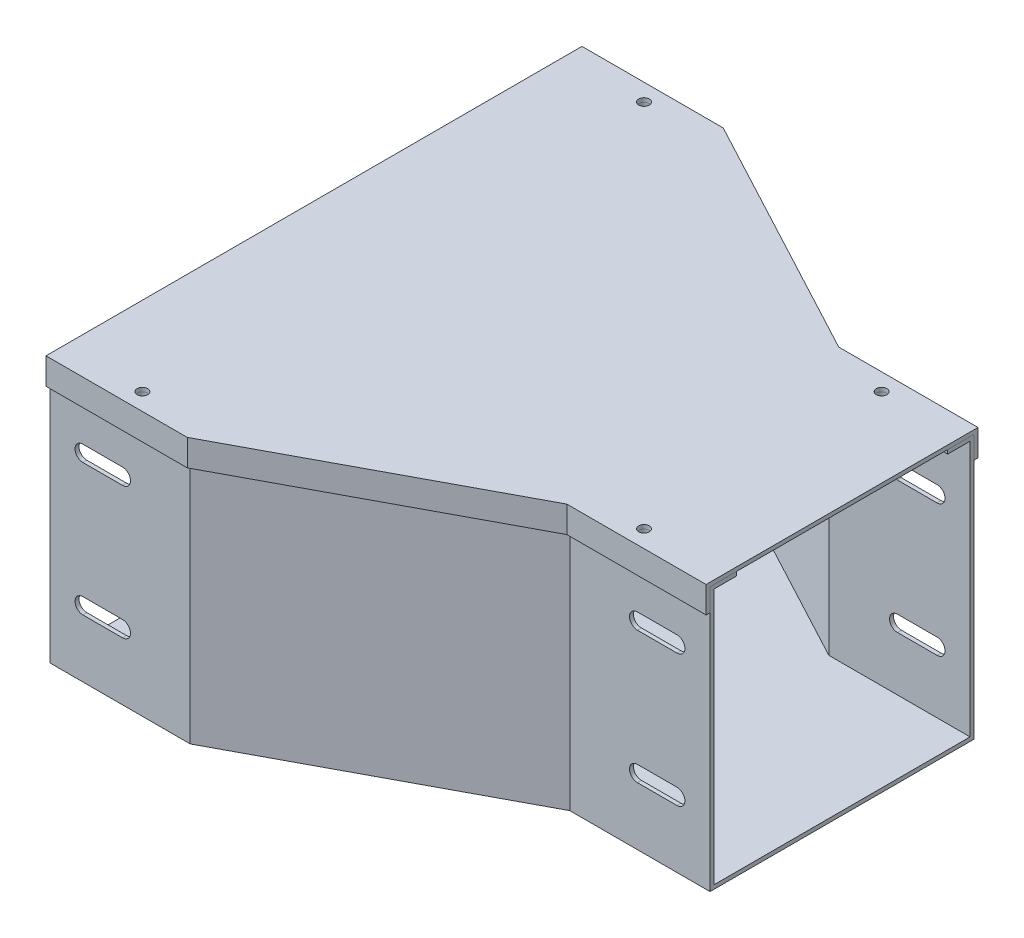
from build123d import *

# Parameters (mm, degrees)
BOSS_EXTRUDE1_DEPTH     = 1.5
EXTRUDE_THIN1_DEPTH     = 100
CUT_EXTRUDE1_DEPTH      = 151
CUT_EXTRUDE1_DEPTH_BACK = 151
EXTRUDE_THIN2_DEPTH     = 1.5
CUT_EXTRUDE2_REACH      = 175.205
SKETCH5_R               = 2
BOSS_EXTRUDE2_DEPTH     = 1.5
EXTRUDE_THIN3_DEPTH     = 10
SKETCH8_R               = 2
CUT_EXTRUDE3_DEPTH      = 1.5


with BuildPart() as part:
    # Sketch1 → Boss-Extrude1 (new body)
    with BuildSketch(Plane(origin=(0, -50, 0), x_dir=(1, 0, 0), z_dir=(0, 1, 0))):
        Polygon((100, 50), (100, -50), (46.875, -50), (0, -75), (-46.875, -100), (-100, -100), (-100, 100), (-46.875, 100), (0, 75), (46.875, 50), align=None)
    extrude(amount=BOSS_EXTRUDE1_DEPTH)

    # Sketch2 → Extrude-Thin1 (add)
    with BuildSketch(Plane(origin=(0, -50, 0), x_dir=(-1, 0, 0), z_dir=(0, -1, 0))):
        Polygon((100, -100), (46.875, -100), (-46.875, -50), (-100, -50), (-100, -48.5), (-46.5, -48.5), (47.25, -98.5), (100, -98.5), align=None)
        Polygon((-100, 50), (-46.875, 50), (46.875, 100), (100, 100), (100, 98.5), (47.25, 98.5), (-46.5, 48.5), (-100, 48.5), align=None)
    extrude(amount=-EXTRUDE_THIN1_DEPTH)

    # Sketch3 → Cut-Extrude1 (cut, two sides: drawn at the far end of the back side and taken through both)
    with BuildSketch(Plane.XY.offset(-CUT_EXTRUDE1_DEPTH_BACK)):
        with BuildLine():
            Line((72.5, 28), (87.5, 28))
            ThreePointArc((87.5, 28), (90.5, 25), (87.5, 22))
            Line((87.5, 22), (72.5, 22))
            ThreePointArc((72.5, 22), (69.5, 25), (72.5, 28))
        make_face()
        with BuildLine():
            Line((72.5, -22), (87.5, -22))
            ThreePointArc((87.5, -22), (90.5, -25), (87.5, -28))
            Line((87.5, -28), (72.5, -28))
            ThreePointArc((72.5, -28), (69.5, -25), (72.5, -22))
        make_face()
        with BuildLine():
            Line((-87.5, 28), (-72.5, 28))
            ThreePointArc((-72.5, 28), (-69.5, 25), (-72.5, 22))
            Line((-72.5, 22), (-87.5, 22))
            ThreePointArc((-87.5, 22), (-90.5, 25), (-87.5, 28))
        make_face()
        with BuildLine():
            Line((-87.5, -22), (-72.5, -22))
            ThreePointArc((-72.5, -22), (-69.5, -25), (-72.5, -28))
            Line((-72.5, -28), (-87.5, -28))
            ThreePointArc((-87.5, -28), (-90.5, -25), (-87.5, -22))
        make_face()
    extrude(amount=CUT_EXTRUDE1_DEPTH + CUT_EXTRUDE1_DEPTH_BACK, mode=Mode.SUBTRACT)

    # Sketch4 → Extrude-Thin2 (add)
    with BuildSketch(Plane(origin=(0, 50, 0), x_dir=(1, 0, 0), z_dir=(0, 1, 0))):
        Polygon((-100, -100), (-46.875, -100), (46.875, -50), (100, -50), (100, -40), (44.375, -40), (-49.375, -90), (-100, -90), align=None)
        Polygon((100, 50), (46.875, 50), (-46.875, 100), (-100, 100), (-100, 90), (-49.375, 90), (44.375, 40), (100, 40), align=None)
    extrude(amount=-EXTRUDE_THIN2_DEPTH)

    # Sketch5 → Cut-Extrude2 (cut, up to next)
    with BuildSketch(Plane(origin=(0, 50, 0), x_dir=(1, 0, 0), z_dir=(0, 1, 0)), mode=Mode.PRIVATE) as cut_extrude2_sk1:
        with Locations(Location((-70, 95, 0), (0, 0, 270))):
            Circle(SKETCH5_R)
    cut_extrude2_tool1 = extrude(cut_extrude2_sk1.sketch, amount=-CUT_EXTRUDE2_REACH, mode=Mode.PRIVATE) & part.part
    # Sketch5 → Cut-Extrude2 (cut, up to next)
    with BuildSketch(Plane(origin=(0, 50, 0), x_dir=(1, 0, 0), z_dir=(0, 1, 0)), mode=Mode.PRIVATE) as cut_extrude2_sk2:
        with Locations(Location((-70, -95, 0), (0, 0, 270))):
            Circle(SKETCH5_R)
    cut_extrude2_tool2 = extrude(cut_extrude2_sk2.sketch, amount=-CUT_EXTRUDE2_REACH, mode=Mode.PRIVATE) & part.part
    # Sketch5 → Cut-Extrude2 (cut, up to next)
    with BuildSketch(Plane(origin=(0, 50, 0), x_dir=(1, 0, 0), z_dir=(0, 1, 0)), mode=Mode.PRIVATE) as cut_extrude2_sk3:
        with Locations(Location((70, 45, 0), (0, 0, 270))):
            Circle(SKETCH5_R)
    cut_extrude2_tool3 = extrude(cut_extrude2_sk3.sketch, amount=-CUT_EXTRUDE2_REACH, mode=Mode.PRIVATE) & part.part
    # Sketch5 → Cut-Extrude2 (cut, up to next)
    with BuildSketch(Plane(origin=(0, 50, 0), x_dir=(1, 0, 0), z_dir=(0, 1, 0)), mode=Mode.PRIVATE) as cut_extrude2_sk4:
        with Locations(Location((70, -45, 0), (0, 0, 270))):
            Circle(SKETCH5_R)
    cut_extrude2_tool4 = extrude(cut_extrude2_sk4.sketch, amount=-CUT_EXTRUDE2_REACH, mode=Mode.PRIVATE) & part.part
    add(cut_extrude2_tool1.solids().sort_by_distance((-70, 50, -95))[0], mode=Mode.SUBTRACT)
    add(cut_extrude2_tool2.solids().sort_by_distance((-70, 50, 95))[0], mode=Mode.SUBTRACT)
    add(cut_extrude2_tool3.solids().sort_by_distance((70, 50, -45))[0], mode=Mode.SUBTRACT)
    add(cut_extrude2_tool4.solids().sort_by_distance((70, 50, 45))[0], mode=Mode.SUBTRACT)


with BuildPart() as body_2:
    # Sketch6 → Boss-Extrude2 (new body)
    with BuildSketch(Plane(origin=(0, 50, 0), x_dir=(1, 0, 0), z_dir=(0, 1, 0))):
        Polygon((-46.875, -100), (0, -75), (46.875, -50), (100, -50), (100, 50), (46.875, 50), (0, 75), (-46.875, 100), (-100, 100), (-100, -100), align=None)
    extrude(amount=BOSS_EXTRUDE2_DEPTH)

    # Sketch7 → Extrude-Thin3 (add)
    with BuildSketch(Plane(origin=(0, 51.5, 0), x_dir=(1, 0, 0), z_dir=(0, 1, 0))):
        Polygon((100, 50), (46.875, 50), (-46.875, 100), (-100, 100), (-100, 101.5), (-46.5, 101.5), (47.25, 51.5), (100, 51.5), align=None)
        Polygon((-100, -100), (-46.875, -100), (46.875, -50), (100, -50), (100, -51.5), (47.25, -51.5), (-46.5, -101.5), (-100, -101.5), align=None)
    extrude(amount=-EXTRUDE_THIN3_DEPTH)

    # Sketch8 → Cut-Extrude3 (cut)
    with BuildSketch(Plane(origin=(0, 51.5, 0), x_dir=(1, 0, 0), z_dir=(0, 1, 0))):
        with Locations(Location((70, -45, 0), (0, 0, 270))):
            Circle(SKETCH8_R)
        with Locations(Location((70, 45, 0), (0, 0, 270))):
            Circle(SKETCH8_R)
        with Locations(Location((-70, -95, 0), (0, 0, 270))):
            Circle(SKETCH8_R)
        with Locations(Location((-70, 95, 0), (0, 0, 270))):
            Circle(SKETCH8_R)
    extrude(amount=-CUT_EXTRUDE3_DEPTH, mode=Mode.SUBTRACT)


solid = Compound([part.part, body_2.part])
